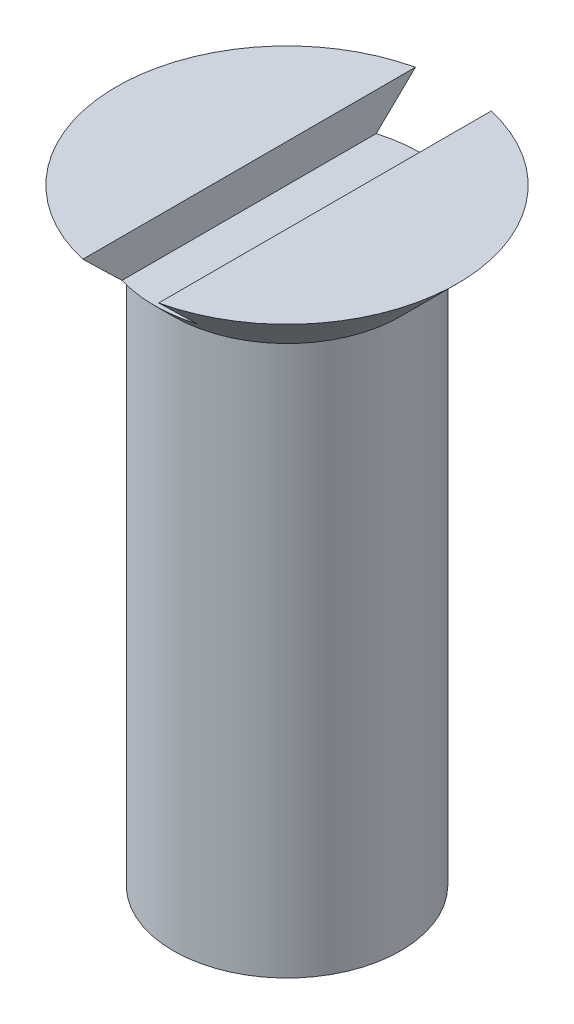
ISO-10303-21;
HEADER;
FILE_DESCRIPTION(('STEP AP214'),'2;1');
FILE_NAME('part.step','',(''),(''),'','','');
FILE_SCHEMA(('AUTOMOTIVE_DESIGN { 1 0 10303 214 1 1 1 1 }'));
ENDSEC;
DATA;
#1=APPLICATION_CONTEXT('core data for automotive mechanical design processes');
#2=APPLICATION_PROTOCOL_DEFINITION('international standard','automotive_design',2000,#1);
#3=PRODUCT_CONTEXT('',#1,'mechanical');
#4=PRODUCT('Part','Part','',(#3));
#5=PRODUCT_RELATED_PRODUCT_CATEGORY('part','',(#4));
#6=PRODUCT_DEFINITION_FORMATION('','',#4);
#7=PRODUCT_DEFINITION_CONTEXT('part definition',#1,'design');
#8=PRODUCT_DEFINITION('design','',#6,#7);
#9=PRODUCT_DEFINITION_SHAPE('','',#8);
#10=(LENGTH_UNIT() NAMED_UNIT(*) SI_UNIT(.MILLI.,.METRE.));
#11=(NAMED_UNIT(*) PLANE_ANGLE_UNIT() SI_UNIT($,.RADIAN.));
#12=(NAMED_UNIT(*) SI_UNIT($,.STERADIAN.) SOLID_ANGLE_UNIT());
#13=UNCERTAINTY_MEASURE_WITH_UNIT(LENGTH_MEASURE(1.E-05),#10,'distance_accuracy_value','');
#14=(GEOMETRIC_REPRESENTATION_CONTEXT(3) GLOBAL_UNCERTAINTY_ASSIGNED_CONTEXT((#13)) GLOBAL_UNIT_ASSIGNED_CONTEXT((#10,
#11,#12)) REPRESENTATION_CONTEXT('',''));
#15=CARTESIAN_POINT('',(0.,0.,0.));
#16=DIRECTION('',(0.,0.,1.));
#17=DIRECTION('',(1.,0.,0.));
#18=AXIS2_PLACEMENT_3D('',#15,#16,#17);
#19=CARTESIAN_POINT('',(4.5,17.7320508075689,0.));
#20=DIRECTION('',(0.,-1.,0.));
#21=DIRECTION('',(0.,0.,-1.));
#22=AXIS2_PLACEMENT_3D('',#19,#20,#21);
#23=PLANE('',#22);
#24=CARTESIAN_POINT('',(0.,17.7320508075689,0.));
#25=DIRECTION('',(0.,1.,0.));
#26=DIRECTION('',(0.,0.,1.));
#27=AXIS2_PLACEMENT_3D('',#24,#25,#26);
#28=CIRCLE('',#27,4.5);
#29=CARTESIAN_POINT('',(1.00000000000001,17.7320508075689,4.38748219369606));
#30=VERTEX_POINT('',#29);
#31=CARTESIAN_POINT('',(1.00000000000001,17.7320508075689,-4.38748219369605));
#32=VERTEX_POINT('',#31);
#33=EDGE_CURVE('E91',#30,#32,#28,.T.);
#34=ORIENTED_EDGE('',*,*,#33,.T.);
#35=DIRECTION('',(0.,0.,1.));
#36=VECTOR('',#35,1.);
#37=CARTESIAN_POINT('',(0.999999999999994,17.7320508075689,0.));
#38=LINE('',#37,#36);
#39=EDGE_CURVE('E79',#32,#30,#38,.T.);
#40=ORIENTED_EDGE('',*,*,#39,.T.);
#41=EDGE_LOOP('',(#34,#40));
#42=FACE_BOUND('',#41,.T.);
#43=ADVANCED_FACE('F32',(#42),#23,.F.);
#44=CARTESIAN_POINT('',(0.,0.,0.));
#45=DIRECTION('',(0.,1.,0.));
#46=DIRECTION('',(0.,0.,1.));
#47=AXIS2_PLACEMENT_3D('',#44,#45,#46);
#48=CONICAL_SURFACE('',#47,0.,1.0471975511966);
#49=CARTESIAN_POINT('',(0.,1.73205080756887,0.));
#50=DIRECTION('',(0.,1.,0.));
#51=DIRECTION('',(0.,0.,1.));
#52=AXIS2_PLACEMENT_3D('',#49,#50,#51);
#53=CIRCLE('',#52,3.);
#54=CARTESIAN_POINT('',(0.,1.73205080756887,3.));
#55=VERTEX_POINT('',#54);
#56=EDGE_CURVE('E80',#55,#55,#53,.T.);
#57=ORIENTED_EDGE('',*,*,#56,.F.);
#58=EDGE_LOOP('',(#57));
#59=FACE_BOUND('',#58,.T.);
#60=CARTESIAN_POINT('',(0.,0.,0.));
#61=VERTEX_POINT('',#60);
#62=VERTEX_LOOP('',#61);
#63=FACE_BOUND('',#62,.T.);
#64=ADVANCED_FACE('F34',(#59,#63),#48,.T.);
#65=CARTESIAN_POINT('',(0.,0.,0.));
#66=DIRECTION('',(0.,1.,0.));
#67=DIRECTION('',(0.,0.,1.));
#68=AXIS2_PLACEMENT_3D('',#65,#66,#67);
#69=CYLINDRICAL_SURFACE('',#68,3.);
#70=CARTESIAN_POINT('',(0.,16.2320508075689,0.));
#71=DIRECTION('',(0.,1.,0.));
#72=DIRECTION('',(0.,0.,1.));
#73=AXIS2_PLACEMENT_3D('',#70,#71,#72);
#74=CIRCLE('',#73,3.);
#75=CARTESIAN_POINT('',(0.,16.2320508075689,3.));
#76=VERTEX_POINT('',#75);
#77=EDGE_CURVE('E95',#76,#76,#74,.T.);
#78=ORIENTED_EDGE('',*,*,#77,.F.);
#79=EDGE_LOOP('',(#78));
#80=FACE_BOUND('',#79,.T.);
#81=ORIENTED_EDGE('',*,*,#56,.T.);
#82=EDGE_LOOP('',(#81));
#83=FACE_BOUND('',#82,.T.);
#84=ADVANCED_FACE('F136',(#80,#83),#69,.T.);
#85=CARTESIAN_POINT('',(0.,16.2320508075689,0.));
#86=DIRECTION('',(0.,1.,0.));
#87=DIRECTION('',(0.,0.,1.));
#88=AXIS2_PLACEMENT_3D('',#85,#86,#87);
#89=CONICAL_SURFACE('',#88,3.,0.785398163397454);
#90=ORIENTED_EDGE('',*,*,#33,.F.);
#91=CARTESIAN_POINT('',(1.,23.1654818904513,9.88296782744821));
#92=CARTESIAN_POINT('',(1.00000000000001,22.8701932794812,9.58616447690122));
#93=CARTESIAN_POINT('',(1.00000000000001,22.5749657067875,9.28930034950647));
#94=CARTESIAN_POINT('',(1.00000000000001,21.9846576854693,8.69535723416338));
#95=CARTESIAN_POINT('',(1.00000000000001,21.689577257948,8.39827822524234));
#96=CARTESIAN_POINT('',(1.00000000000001,21.0987949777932,7.80301219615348));
#97=CARTESIAN_POINT('',(1.00000000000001,20.8030938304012,7.50482447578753));
#98=CARTESIAN_POINT('',(1.00000000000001,20.2120732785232,6.90813868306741));
#99=CARTESIAN_POINT('',(1.00000000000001,19.9167538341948,6.60964065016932));
#100=CARTESIAN_POINT('',(1.00000000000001,19.2342329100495,5.91862030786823));
#101=CARTESIAN_POINT('',(1.00000000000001,18.8472119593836,5.52591939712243));
#102=CARTESIAN_POINT('',(1.00000000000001,18.267808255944,4.93560843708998));
#103=CARTESIAN_POINT('',(1.00000000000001,18.0748237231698,4.73858923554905));
#104=CARTESIAN_POINT('',(1.00000000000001,17.689448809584,4.34398634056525));
#105=CARTESIAN_POINT('',(1.00000000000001,17.4970584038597,4.14640267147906));
#106=CARTESIAN_POINT('',(1.00000000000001,17.1136431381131,3.75088106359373));
#107=CARTESIAN_POINT('',(1.00000000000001,16.9226160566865,3.55294527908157));
#108=CARTESIAN_POINT('',(1.00000000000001,16.5419166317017,3.15570847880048));
#109=CARTESIAN_POINT('',(1.00000000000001,16.3522445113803,2.95640724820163));
#110=CARTESIAN_POINT('',(1.00000000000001,16.0696608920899,2.65578069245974));
#111=CARTESIAN_POINT('',(1.00000000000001,15.9758206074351,2.55532924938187));
#112=CARTESIAN_POINT('',(1.00000000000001,15.7890135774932,2.35361827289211));
#113=CARTESIAN_POINT('',(1.00000000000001,15.6960468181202,2.25235875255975));
#114=CARTESIAN_POINT('',(1.00000000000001,15.5113971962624,2.04872217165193));
#115=CARTESIAN_POINT('',(1.00000000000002,15.4197140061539,1.94634540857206));
#116=CARTESIAN_POINT('',(0.999999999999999,15.2382564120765,1.7399176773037));
#117=CARTESIAN_POINT('',(0.999999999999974,15.1484818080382,1.63586688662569));
#118=CARTESIAN_POINT('',(0.999999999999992,15.0253233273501,1.48873658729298));
#119=CARTESIAN_POINT('',(1.,14.990613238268,1.44676815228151));
#120=CARTESIAN_POINT('',(1.00000000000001,14.9218166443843,1.36231850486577));
#121=CARTESIAN_POINT('',(1.00000000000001,14.8877301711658,1.31983726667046));
#122=CARTESIAN_POINT('',(1.00000000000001,14.8202773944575,1.23416465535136));
#123=CARTESIAN_POINT('',(1.00000000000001,14.7869127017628,1.1909720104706));
#124=CARTESIAN_POINT('',(1.00000000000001,14.7212075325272,1.10381542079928));
#125=CARTESIAN_POINT('',(1.00000000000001,14.6888669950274,1.0598515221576));
#126=CARTESIAN_POINT('',(1.00000000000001,14.6261084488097,0.971768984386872));
#127=CARTESIAN_POINT('',(1.00000000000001,14.5956661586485,0.927667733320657));
#128=CARTESIAN_POINT('',(1.00000000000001,14.5365234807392,0.838314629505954));
#129=CARTESIAN_POINT('',(1.00000000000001,14.5078227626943,0.793062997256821));
#130=CARTESIAN_POINT('',(1.00000000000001,14.4528751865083,0.701257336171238));
#131=CARTESIAN_POINT('',(1.,14.4266215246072,0.654707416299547));
#132=CARTESIAN_POINT('',(1.00000000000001,14.377414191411,0.559908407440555));
#133=CARTESIAN_POINT('',(1.00000000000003,14.3544575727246,0.511660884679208));
#134=CARTESIAN_POINT('',(1.00000000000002,14.3208796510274,0.431655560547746));
#135=CARTESIAN_POINT('',(1.00000000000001,14.3088581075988,0.400487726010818));
#136=CARTESIAN_POINT('',(1.00000000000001,14.2870138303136,0.337377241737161));
#137=CARTESIAN_POINT('',(1.00000000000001,14.277191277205,0.305434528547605));
#138=CARTESIAN_POINT('',(1.00000000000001,14.260222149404,0.241028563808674));
#139=CARTESIAN_POINT('',(1.,14.2530608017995,0.208569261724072));
#140=CARTESIAN_POINT('',(1.00000000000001,14.2417292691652,0.143134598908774));
#141=CARTESIAN_POINT('',(1.00000000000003,14.2375580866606,0.110159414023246));
#142=CARTESIAN_POINT('',(1.00000000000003,14.2324443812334,0.0435882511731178));
#143=CARTESIAN_POINT('',(1.00000000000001,14.2315379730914,0.00998943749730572));
#144=CARTESIAN_POINT('',(1.,14.2331190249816,-0.0571258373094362));
#145=CARTESIAN_POINT('',(1.00000000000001,14.235606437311,-0.0906422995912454));
#146=CARTESIAN_POINT('',(1.00000000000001,14.2438174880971,-0.157398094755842));
#147=CARTESIAN_POINT('',(1.,14.2495533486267,-0.190635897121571));
#148=CARTESIAN_POINT('',(1.00000000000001,14.2639184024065,-0.256485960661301));
#149=CARTESIAN_POINT('',(1.00000000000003,14.2725491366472,-0.289097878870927));
#150=CARTESIAN_POINT('',(1.00000000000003,14.2969346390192,-0.368812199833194));
#151=CARTESIAN_POINT('',(1.00000000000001,14.3141281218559,-0.415472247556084));
#152=CARTESIAN_POINT('',(1.,14.3525082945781,-0.507110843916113));
#153=CARTESIAN_POINT('',(1.00000000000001,14.3736979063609,-0.552088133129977));
#154=CARTESIAN_POINT('',(1.00000000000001,14.4190955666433,-0.640726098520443));
#155=CARTESIAN_POINT('',(1.,14.4433166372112,-0.684380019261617));
#156=CARTESIAN_POINT('',(1.00000000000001,14.4939088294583,-0.770385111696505));
#157=CARTESIAN_POINT('',(1.00000000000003,14.52027907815,-0.812736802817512));
#158=CARTESIAN_POINT('',(1.00000000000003,14.5796739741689,-0.904164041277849));
#159=CARTESIAN_POINT('',(1.00000000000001,14.6130245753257,-0.953026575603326));
#160=CARTESIAN_POINT('',(1.,14.6813612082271,-1.04959881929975));
#161=CARTESIAN_POINT('',(1.00000000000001,14.7163475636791,-1.09730829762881));
#162=CARTESIAN_POINT('',(1.00000000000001,14.8231460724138,-1.23915128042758));
#163=CARTESIAN_POINT('',(1.00000000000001,14.8967510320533,-1.33193040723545));
#164=CARTESIAN_POINT('',(1.00000000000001,15.0469174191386,-1.5154166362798));
#165=CARTESIAN_POINT('',(1.00000000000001,15.1234858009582,-1.60611795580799));
#166=CARTESIAN_POINT('',(1.00000000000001,15.2783838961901,-1.78593414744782));
#167=CARTESIAN_POINT('',(1.00000000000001,15.3567128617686,-1.87504966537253));
#168=CARTESIAN_POINT('',(1.00000000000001,15.5149077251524,-2.0525734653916));
#169=CARTESIAN_POINT('',(1.00000000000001,15.5947786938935,-2.14097720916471));
#170=CARTESIAN_POINT('',(1.00000000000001,15.7553883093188,-2.31700831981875));
#171=CARTESIAN_POINT('',(1.00000000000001,15.8361270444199,-2.40463560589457));
#172=CARTESIAN_POINT('',(1.00000000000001,15.9981044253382,-2.57916762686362));
#173=CARTESIAN_POINT('',(1.,16.0793420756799,-2.66607328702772));
#174=CARTESIAN_POINT('',(1.00000000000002,16.242287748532,-2.83943638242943));
#175=CARTESIAN_POINT('',(1.00000000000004,16.3239957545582,-2.92589383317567));
#176=CARTESIAN_POINT('',(1.00000000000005,16.5460076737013,-3.15982416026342));
#177=CARTESIAN_POINT('',(1.00000000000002,16.6866610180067,-3.30696526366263));
#178=CARTESIAN_POINT('',(0.999999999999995,16.9686811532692,-3.60056256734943));
#179=CARTESIAN_POINT('',(1.,17.1100479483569,-3.74701876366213));
#180=CARTESIAN_POINT('',(1.00000000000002,17.5348993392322,-4.18567522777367));
#181=CARTESIAN_POINT('',(1.00000000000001,17.8191271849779,-4.47715525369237));
#182=CARTESIAN_POINT('',(1.00000000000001,18.3888736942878,-5.05927870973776));
#183=CARTESIAN_POINT('',(1.00000000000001,18.6743931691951,-5.34992134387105));
#184=CARTESIAN_POINT('',(1.00000000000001,19.2460984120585,-5.93054278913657));
#185=CARTESIAN_POINT('',(1.00000000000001,19.5322841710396,-6.22052160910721));
#186=CARTESIAN_POINT('',(1.00000000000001,20.0971470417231,-6.79200718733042));
#187=CARTESIAN_POINT('',(1.00000000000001,20.3758121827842,-7.0735257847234));
#188=CARTESIAN_POINT('',(1.00000000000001,20.9334334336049,-7.63627708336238));
#189=CARTESIAN_POINT('',(1.00000000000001,21.2123895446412,-7.91750978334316));
#190=CARTESIAN_POINT('',(1.00000000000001,21.7702803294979,-8.47953560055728));
#191=CARTESIAN_POINT('',(1.00000000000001,22.0492148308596,-8.76032888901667));
#192=CARTESIAN_POINT('',(1.00000000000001,22.6072418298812,-9.32175567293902));
#193=CARTESIAN_POINT('',(1.00000000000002,22.8863343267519,-9.60238916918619));
#194=CARTESIAN_POINT('',(1.00000000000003,23.1654818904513,-9.8829678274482));
#195=B_SPLINE_CURVE_WITH_KNOTS('',3,(#91,#92,#93,#94,#95,#96,#97,#98,#99,#100,#101,#102,#103,
#104,#105,#106,#107,#108,#109,#110,#111,#112,#113,#114,#115,#116,#117,#118,#119,#120,#121,#122,
#123,#124,#125,#126,#127,#128,#129,#130,#131,#132,#133,#134,#135,#136,#137,#138,#139,#140,#141,
#142,#143,#144,#145,#146,#147,#148,#149,#150,#151,#152,#153,#154,#155,#156,#157,#158,#159,#160,
#161,#162,#163,#164,#165,#166,#167,#168,#169,#170,#171,#172,#173,#174,#175,#176,#177,#178,#179,
#180,#181,#182,#183,#184,#185,#186,#187,#188,#189,#190,#191,#192,#193,#194),.UNSPECIFIED.,.F.,
.F.,(4,2,2,2,2,2,2,2,2,2,2,2,2,2,2,2,2,2,2,2,2,2,2,2,2,2,2,2,2,2,2,2,2,2,2,2,2,2,2,2,2,2,2,2,2,
2,2,2,2,2,2,4),(0.,1.25602087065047,2.51218781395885,3.77202712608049,5.03172214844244,
6.6858026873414,7.51316910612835,8.34050034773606,9.16574255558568,9.99111772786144,
10.4035079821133,10.8158915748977,11.2281679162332,11.6404008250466,11.8037831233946,
11.9671736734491,12.1308975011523,12.2946115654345,12.4553451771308,12.6160482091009,
12.7762901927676,12.9363880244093,13.0365402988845,13.1367008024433,13.2362966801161,
13.3358593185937,13.436519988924,13.5371792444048,13.6382197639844,13.7393141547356,
13.8882269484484,14.037249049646,14.1869348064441,14.3365600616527,14.5139899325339,
14.6914550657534,15.046634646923,15.4027053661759,15.7586275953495,16.1160437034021,
16.473496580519,16.8303827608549,17.1872565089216,17.7979117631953,18.40857055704,
19.6299218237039,20.8521935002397,22.074448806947,23.2627931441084,24.4511427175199,
25.638511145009,26.8258736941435),.UNSPECIFIED.);
#196=CARTESIAN_POINT('',(1.00000000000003,16.7320508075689,3.35410196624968));
#197=VERTEX_POINT('',#196);
#198=EDGE_CURVE('E92',#30,#197,#195,.T.);
#199=ORIENTED_EDGE('',*,*,#198,.T.);
#200=CARTESIAN_POINT('',(0.,16.7320508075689,0.));
#201=DIRECTION('',(0.,-1.,0.));
#202=DIRECTION('',(0.,0.,-1.));
#203=AXIS2_PLACEMENT_3D('',#200,#201,#202);
#204=CIRCLE('',#203,3.49999999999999);
#205=CARTESIAN_POINT('',(-0.999999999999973,16.7320508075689,3.35410196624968));
#206=VERTEX_POINT('',#205);
#207=EDGE_CURVE('E11',#197,#206,#204,.T.);
#208=ORIENTED_EDGE('',*,*,#207,.T.);
#209=CARTESIAN_POINT('',(-0.999999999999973,23.1654818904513,-9.8829678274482));
#210=CARTESIAN_POINT('',(-0.999999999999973,22.8701932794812,-9.58616447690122));
#211=CARTESIAN_POINT('',(-0.999999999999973,22.5749657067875,-9.28930034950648));
#212=CARTESIAN_POINT('',(-0.999999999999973,21.9846576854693,-8.6953572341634));
#213=CARTESIAN_POINT('',(-0.999999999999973,21.689577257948,-8.39827822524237));
#214=CARTESIAN_POINT('',(-0.999999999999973,21.0987949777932,-7.80301219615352));
#215=CARTESIAN_POINT('',(-0.999999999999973,20.8030938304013,-7.50482447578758));
#216=CARTESIAN_POINT('',(-0.999999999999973,20.2120732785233,-6.90813868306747));
#217=CARTESIAN_POINT('',(-0.999999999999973,19.9167538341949,-6.60964065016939));
#218=CARTESIAN_POINT('',(-0.999999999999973,19.2342329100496,-5.91862030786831));
#219=CARTESIAN_POINT('',(-0.999999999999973,18.8472119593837,-5.5259193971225));
#220=CARTESIAN_POINT('',(-0.999999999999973,18.267808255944,-4.93560843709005));
#221=CARTESIAN_POINT('',(-0.999999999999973,18.0748237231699,-4.73858923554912));
#222=CARTESIAN_POINT('',(-0.999999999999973,17.6894488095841,-4.34398634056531));
#223=CARTESIAN_POINT('',(-0.999999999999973,17.4970584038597,-4.14640267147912));
#224=CARTESIAN_POINT('',(-0.999999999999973,17.1136431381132,-3.75088106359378));
#225=CARTESIAN_POINT('',(-0.999999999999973,16.9226160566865,-3.55294527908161));
#226=CARTESIAN_POINT('',(-0.999999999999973,16.5419166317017,-3.15570847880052));
#227=CARTESIAN_POINT('',(-0.999999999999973,16.3522445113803,-2.95640724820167));
#228=CARTESIAN_POINT('',(-0.999999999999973,16.0696608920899,-2.65578069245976));
#229=CARTESIAN_POINT('',(-0.999999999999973,15.9758206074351,-2.5553292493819));
#230=CARTESIAN_POINT('',(-0.999999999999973,15.7890135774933,-2.35361827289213));
#231=CARTESIAN_POINT('',(-0.999999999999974,15.6960468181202,-2.25235875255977));
#232=CARTESIAN_POINT('',(-0.999999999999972,15.5113971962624,-2.04872217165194));
#233=CARTESIAN_POINT('',(-0.99999999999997,15.4197140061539,-1.94634540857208));
#234=CARTESIAN_POINT('',(-0.999999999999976,15.2382564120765,-1.73991767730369));
#235=CARTESIAN_POINT('',(-0.999999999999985,15.1484818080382,-1.63586688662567));
#236=CARTESIAN_POINT('',(-0.999999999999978,15.0253233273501,-1.48873658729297));
#237=CARTESIAN_POINT('',(-0.999999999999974,14.990613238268,-1.4467681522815));
#238=CARTESIAN_POINT('',(-0.999999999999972,14.9218166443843,-1.36231850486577));
#239=CARTESIAN_POINT('',(-0.999999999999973,14.8877301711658,-1.31983726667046));
#240=CARTESIAN_POINT('',(-0.999999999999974,14.8202773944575,-1.23416465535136));
#241=CARTESIAN_POINT('',(-0.999999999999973,14.7869127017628,-1.1909720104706));
#242=CARTESIAN_POINT('',(-0.999999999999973,14.7212075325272,-1.10381542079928));
#243=CARTESIAN_POINT('',(-0.999999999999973,14.6888669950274,-1.05985152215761));
#244=CARTESIAN_POINT('',(-0.999999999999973,14.6261084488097,-0.971768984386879));
#245=CARTESIAN_POINT('',(-0.999999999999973,14.5956661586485,-0.927667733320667));
#246=CARTESIAN_POINT('',(-0.999999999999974,14.5365234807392,-0.838314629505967));
#247=CARTESIAN_POINT('',(-0.999999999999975,14.5078227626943,-0.793062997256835));
#248=CARTESIAN_POINT('',(-0.999999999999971,14.4528751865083,-0.701257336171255));
#249=CARTESIAN_POINT('',(-0.999999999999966,14.4266215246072,-0.654707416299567));
#250=CARTESIAN_POINT('',(-0.99999999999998,14.377414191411,-0.559908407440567));
#251=CARTESIAN_POINT('',(-0.999999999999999,14.3544575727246,-0.51166088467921));
#252=CARTESIAN_POINT('',(-0.99999999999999,14.3208796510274,-0.431655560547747));
#253=CARTESIAN_POINT('',(-0.999999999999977,14.3088581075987,-0.400487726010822));
#254=CARTESIAN_POINT('',(-0.999999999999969,14.2870138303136,-0.337377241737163));
#255=CARTESIAN_POINT('',(-0.999999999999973,14.2771912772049,-0.305434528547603));
#256=CARTESIAN_POINT('',(-0.999999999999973,14.260222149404,-0.241028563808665));
#257=CARTESIAN_POINT('',(-0.999999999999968,14.2530608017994,-0.208569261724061));
#258=CARTESIAN_POINT('',(-0.999999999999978,14.2417292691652,-0.143134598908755));
#259=CARTESIAN_POINT('',(-0.999999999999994,14.2375580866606,-0.11015941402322));
#260=CARTESIAN_POINT('',(-0.999999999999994,14.2324443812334,-0.0435882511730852));
#261=CARTESIAN_POINT('',(-0.999999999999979,14.2315379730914,-0.00998943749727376));
#262=CARTESIAN_POINT('',(-0.999999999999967,14.2331190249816,0.0571258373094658));
#263=CARTESIAN_POINT('',(-0.999999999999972,14.235606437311,0.0906422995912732));
#264=CARTESIAN_POINT('',(-0.999999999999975,14.2438174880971,0.157398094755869));
#265=CARTESIAN_POINT('',(-0.999999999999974,14.2495533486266,0.190635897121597));
#266=CARTESIAN_POINT('',(-0.999999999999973,14.2639184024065,0.256485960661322));
#267=CARTESIAN_POINT('',(-0.999999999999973,14.2725491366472,0.289097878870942));
#268=CARTESIAN_POINT('',(-0.999999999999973,14.2969346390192,0.368812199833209));
#269=CARTESIAN_POINT('',(-0.999999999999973,14.3141281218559,0.415472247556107));
#270=CARTESIAN_POINT('',(-0.999999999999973,14.3525082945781,0.507110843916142));
#271=CARTESIAN_POINT('',(-0.999999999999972,14.3736979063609,0.552088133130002));
#272=CARTESIAN_POINT('',(-0.999999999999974,14.4190955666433,0.640726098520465));
#273=CARTESIAN_POINT('',(-0.999999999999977,14.4433166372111,0.684380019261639));
#274=CARTESIAN_POINT('',(-0.99999999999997,14.4939088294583,0.770385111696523));
#275=CARTESIAN_POINT('',(-0.99999999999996,14.52027907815,0.812736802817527));
#276=CARTESIAN_POINT('',(-0.999999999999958,14.5796739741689,0.904164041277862));
#277=CARTESIAN_POINT('',(-0.999999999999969,14.6130245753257,0.953026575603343));
#278=CARTESIAN_POINT('',(-0.999999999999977,14.681361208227,1.04959881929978));
#279=CARTESIAN_POINT('',(-0.999999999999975,14.7163475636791,1.09730829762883));
#280=CARTESIAN_POINT('',(-0.99999999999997,14.8231460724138,1.23915128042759));
#281=CARTESIAN_POINT('',(-0.999999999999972,14.8967510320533,1.33193040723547));
#282=CARTESIAN_POINT('',(-0.999999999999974,15.0469174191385,1.51541663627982));
#283=CARTESIAN_POINT('',(-0.999999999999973,15.1234858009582,1.606117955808));
#284=CARTESIAN_POINT('',(-0.999999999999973,15.2783838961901,1.78593414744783));
#285=CARTESIAN_POINT('',(-0.999999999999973,15.3567128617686,1.87504966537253));
#286=CARTESIAN_POINT('',(-0.999999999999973,15.5149077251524,2.0525734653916));
#287=CARTESIAN_POINT('',(-0.999999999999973,15.5947786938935,2.14097720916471));
#288=CARTESIAN_POINT('',(-0.999999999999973,15.7553883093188,2.31700831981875));
#289=CARTESIAN_POINT('',(-0.999999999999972,15.8361270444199,2.40463560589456));
#290=CARTESIAN_POINT('',(-0.999999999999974,15.9981044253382,2.57916762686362));
#291=CARTESIAN_POINT('',(-0.999999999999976,16.0793420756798,2.66607328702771));
#292=CARTESIAN_POINT('',(-0.99999999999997,16.2422877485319,2.83943638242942));
#293=CARTESIAN_POINT('',(-0.999999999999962,16.3239957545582,2.92589383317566));
#294=CARTESIAN_POINT('',(-0.999999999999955,16.5460076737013,3.1598241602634));
#295=CARTESIAN_POINT('',(-0.999999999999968,16.6866610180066,3.30696526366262));
#296=CARTESIAN_POINT('',(-0.999999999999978,16.9686811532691,3.60056256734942));
#297=CARTESIAN_POINT('',(-0.999999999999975,17.1100479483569,3.74701876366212));
#298=CARTESIAN_POINT('',(-0.99999999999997,17.5348993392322,4.18567522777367));
#299=CARTESIAN_POINT('',(-0.999999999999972,17.8191271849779,4.47715525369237));
#300=CARTESIAN_POINT('',(-0.999999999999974,18.3888736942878,5.05927870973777));
#301=CARTESIAN_POINT('',(-0.999999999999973,18.6743931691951,5.34992134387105));
#302=CARTESIAN_POINT('',(-0.999999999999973,19.2460984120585,5.93054278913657));
#303=CARTESIAN_POINT('',(-0.999999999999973,19.5322841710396,6.22052160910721));
#304=CARTESIAN_POINT('',(-0.999999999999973,20.0971470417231,6.79200718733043));
#305=CARTESIAN_POINT('',(-0.999999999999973,20.3758121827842,7.07352578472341));
#306=CARTESIAN_POINT('',(-0.999999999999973,20.9334334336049,7.63627708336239));
#307=CARTESIAN_POINT('',(-0.999999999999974,21.2123895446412,7.91750978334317));
#308=CARTESIAN_POINT('',(-0.999999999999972,21.7702803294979,8.47953560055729));
#309=CARTESIAN_POINT('',(-0.999999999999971,22.0492148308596,8.76032888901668));
#310=CARTESIAN_POINT('',(-0.999999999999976,22.6072418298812,9.32175567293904));
#311=CARTESIAN_POINT('',(-0.999999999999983,22.8863343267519,9.60238916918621));
#312=CARTESIAN_POINT('',(-1.,23.1654818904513,9.88296782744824));
#313=B_SPLINE_CURVE_WITH_KNOTS('',3,(#209,#210,#211,#212,#213,#214,#215,#216,#217,#218,#219,
#220,#221,#222,#223,#224,#225,#226,#227,#228,#229,#230,#231,#232,#233,#234,#235,#236,#237,#238,
#239,#240,#241,#242,#243,#244,#245,#246,#247,#248,#249,#250,#251,#252,#253,#254,#255,#256,#257,
#258,#259,#260,#261,#262,#263,#264,#265,#266,#267,#268,#269,#270,#271,#272,#273,#274,#275,#276,
#277,#278,#279,#280,#281,#282,#283,#284,#285,#286,#287,#288,#289,#290,#291,#292,#293,#294,#295,
#296,#297,#298,#299,#300,#301,#302,#303,#304,#305,#306,#307,#308,#309,#310,#311,#312),
.UNSPECIFIED.,.F.,.F.,(4,2,2,2,2,2,2,2,2,2,2,2,2,2,2,2,2,2,2,2,2,2,2,2,2,2,2,2,2,2,2,2,2,2,2,2,
2,2,2,2,2,2,2,2,2,2,2,2,2,2,2,4),(0.,1.25602087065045,2.5121878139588,3.7720271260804,
5.03172214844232,6.6858026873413,7.51316910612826,8.34050034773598,9.16574255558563,
9.9911177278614,10.4035079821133,10.8158915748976,11.2281679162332,11.6404008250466,
11.8037831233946,11.9671736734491,12.1308975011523,12.2946115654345,12.4553451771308,
12.6160482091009,12.7762901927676,12.9363880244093,13.0365402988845,13.1367008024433,
13.2362966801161,13.3358593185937,13.4365199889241,13.5371792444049,13.6382197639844,
13.7393141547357,13.8882269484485,14.037249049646,14.1869348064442,14.3365600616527,
14.5139899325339,14.6914550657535,15.046634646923,15.4027053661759,15.7586275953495,
16.1160437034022,16.4734965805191,16.8303827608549,17.1872565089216,17.7979117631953,
18.40857055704,19.6299218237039,20.8521935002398,22.0744488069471,23.2627931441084,
24.4511427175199,25.638511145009,26.8258736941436),.UNSPECIFIED.);
#314=CARTESIAN_POINT('',(-0.999999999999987,17.7320508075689,4.38748219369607));
#315=VERTEX_POINT('',#314);
#316=EDGE_CURVE('E74',#206,#315,#313,.T.);
#317=ORIENTED_EDGE('',*,*,#316,.T.);
#318=CARTESIAN_POINT('',(-0.999999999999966,17.7320508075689,-4.38748219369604));
#319=VERTEX_POINT('',#318);
#320=EDGE_CURVE('E86',#319,#315,#28,.T.);
#321=ORIENTED_EDGE('',*,*,#320,.F.);
#322=CARTESIAN_POINT('',(-1.,16.7320508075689,-3.35410196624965));
#323=VERTEX_POINT('',#322);
#324=EDGE_CURVE('E47',#319,#323,#313,.T.);
#325=ORIENTED_EDGE('',*,*,#324,.T.);
#326=CARTESIAN_POINT('',(1.,16.7320508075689,-3.35410196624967));
#327=VERTEX_POINT('',#326);
#328=EDGE_CURVE('E36',#323,#327,#204,.T.);
#329=ORIENTED_EDGE('',*,*,#328,.T.);
#330=EDGE_CURVE('E96',#327,#32,#195,.T.);
#331=ORIENTED_EDGE('',*,*,#330,.T.);
#332=EDGE_LOOP('',(#90,#199,#208,#317,#321,#325,#329,#331));
#333=FACE_BOUND('',#332,.T.);
#334=ORIENTED_EDGE('',*,*,#77,.T.);
#335=EDGE_LOOP('',(#334));
#336=FACE_BOUND('',#335,.T.);
#337=ADVANCED_FACE('F84',(#333,#336),#89,.T.);
#338=ORIENTED_EDGE('',*,*,#320,.T.);
#339=DIRECTION('',(0.,0.,-1.));
#340=VECTOR('',#339,1.);
#341=CARTESIAN_POINT('',(-1.,17.7320508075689,0.));
#342=LINE('',#341,#340);
#343=EDGE_CURVE('E71',#315,#319,#342,.T.);
#344=ORIENTED_EDGE('',*,*,#343,.T.);
#345=EDGE_LOOP('',(#338,#344));
#346=FACE_BOUND('',#345,.T.);
#347=ADVANCED_FACE('F90',(#346),#23,.F.);
#348=CARTESIAN_POINT('',(1.00000000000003,16.7320508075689,-5.25461279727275));
#349=DIRECTION('',(0.,-1.,0.));
#350=DIRECTION('',(0.,0.,-1.));
#351=AXIS2_PLACEMENT_3D('',#348,#349,#350);
#352=PLANE('',#351);
#353=DIRECTION('',(0.,0.,-1.));
#354=VECTOR('',#353,1.);
#355=CARTESIAN_POINT('',(1.00000000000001,16.7320508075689,5.25461279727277));
#356=LINE('',#355,#354);
#357=EDGE_CURVE('E115',#197,#327,#356,.T.);
#358=ORIENTED_EDGE('',*,*,#357,.T.);
#359=ORIENTED_EDGE('',*,*,#328,.F.);
#360=DIRECTION('',(0.,0.,1.));
#361=VECTOR('',#360,1.);
#362=CARTESIAN_POINT('',(-0.999999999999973,16.7320508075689,5.25461279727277));
#363=LINE('',#362,#361);
#364=EDGE_CURVE('E88',#323,#206,#363,.T.);
#365=ORIENTED_EDGE('',*,*,#364,.T.);
#366=ORIENTED_EDGE('',*,*,#207,.F.);
#367=EDGE_LOOP('',(#358,#359,#365,#366));
#368=FACE_BOUND('',#367,.T.);
#369=ADVANCED_FACE('F113',(#368),#352,.F.);
#370=CARTESIAN_POINT('',(1.00000000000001,16.7320508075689,5.25461279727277));
#371=DIRECTION('',(1.,0.,0.));
#372=DIRECTION('',(0.,0.,-1.));
#373=AXIS2_PLACEMENT_3D('',#370,#371,#372);
#374=PLANE('',#373);
#375=ORIENTED_EDGE('',*,*,#39,.F.);
#376=ORIENTED_EDGE('',*,*,#330,.F.);
#377=ORIENTED_EDGE('',*,*,#357,.F.);
#378=ORIENTED_EDGE('',*,*,#198,.F.);
#379=EDGE_LOOP('',(#375,#376,#377,#378));
#380=FACE_BOUND('',#379,.T.);
#381=ADVANCED_FACE('F127',(#380),#374,.F.);
#382=CARTESIAN_POINT('',(-0.999999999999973,16.7320508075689,5.25461279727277));
#383=DIRECTION('',(-1.,0.,0.));
#384=DIRECTION('',(0.,0.,1.));
#385=AXIS2_PLACEMENT_3D('',#382,#383,#384);
#386=PLANE('',#385);
#387=ORIENTED_EDGE('',*,*,#343,.F.);
#388=ORIENTED_EDGE('',*,*,#316,.F.);
#389=ORIENTED_EDGE('',*,*,#364,.F.);
#390=ORIENTED_EDGE('',*,*,#324,.F.);
#391=EDGE_LOOP('',(#387,#388,#389,#390));
#392=FACE_BOUND('',#391,.T.);
#393=ADVANCED_FACE('F73',(#392),#386,.F.);
#394=CLOSED_SHELL('',(#43,#64,#84,#337,#347,#369,#381,#393));
#395=MANIFOLD_SOLID_BREP('B2',#394);
#396=ADVANCED_BREP_SHAPE_REPRESENTATION('',(#18,#395),#14);
#397=SHAPE_DEFINITION_REPRESENTATION(#9,#396);
ENDSEC;
END-ISO-10303-21;
